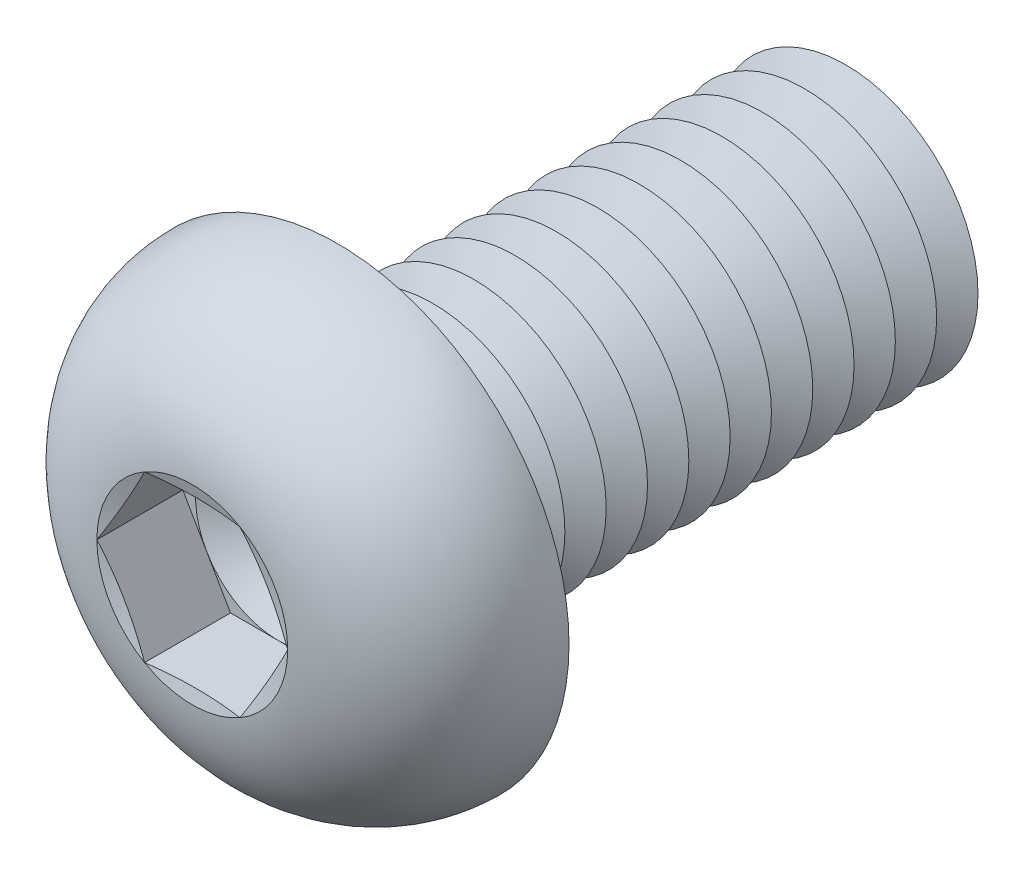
ISO-10303-21;
HEADER;
FILE_DESCRIPTION(('STEP AP214'),'2;1');
FILE_NAME('part.step','',(''),(''),'','','');
FILE_SCHEMA(('AUTOMOTIVE_DESIGN { 1 0 10303 214 1 1 1 1 }'));
ENDSEC;
DATA;
#1=APPLICATION_CONTEXT('core data for automotive mechanical design processes');
#2=APPLICATION_PROTOCOL_DEFINITION('international standard','automotive_design',2000,#1);
#3=PRODUCT_CONTEXT('',#1,'mechanical');
#4=PRODUCT('Part','Part','',(#3));
#5=PRODUCT_RELATED_PRODUCT_CATEGORY('part','',(#4));
#6=PRODUCT_DEFINITION_FORMATION('','',#4);
#7=PRODUCT_DEFINITION_CONTEXT('part definition',#1,'design');
#8=PRODUCT_DEFINITION('design','',#6,#7);
#9=PRODUCT_DEFINITION_SHAPE('','',#8);
#10=(LENGTH_UNIT() NAMED_UNIT(*) SI_UNIT(.MILLI.,.METRE.));
#11=(NAMED_UNIT(*) PLANE_ANGLE_UNIT() SI_UNIT($,.RADIAN.));
#12=(NAMED_UNIT(*) SI_UNIT($,.STERADIAN.) SOLID_ANGLE_UNIT());
#13=UNCERTAINTY_MEASURE_WITH_UNIT(LENGTH_MEASURE(1.E-05),#10,'distance_accuracy_value','');
#14=(GEOMETRIC_REPRESENTATION_CONTEXT(3) GLOBAL_UNCERTAINTY_ASSIGNED_CONTEXT((#13)) GLOBAL_UNIT_ASSIGNED_CONTEXT((#10,
#11,#12)) REPRESENTATION_CONTEXT('',''));
#15=CARTESIAN_POINT('',(0.,0.,0.));
#16=DIRECTION('',(0.,0.,1.));
#17=DIRECTION('',(1.,0.,0.));
#18=AXIS2_PLACEMENT_3D('',#15,#16,#17);
#19=CARTESIAN_POINT('',(0.,0.,1.8));
#20=DIRECTION('',(0.,0.,1.));
#21=DIRECTION('',(1.,0.,0.));
#22=AXIS2_PLACEMENT_3D('',#19,#20,#21);
#23=PLANE('',#22);
#24=CARTESIAN_POINT('',(0.,0.,1.8));
#25=DIRECTION('',(0.,0.,1.));
#26=DIRECTION('',(1.,0.,0.));
#27=AXIS2_PLACEMENT_3D('',#24,#25,#26);
#28=CIRCLE('',#27,2.49999883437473);
#29=CARTESIAN_POINT('',(2.1650625,1.24999941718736,1.8));
#30=VERTEX_POINT('',#29);
#31=CARTESIAN_POINT('',(0.,2.49999883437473,1.8));
#32=VERTEX_POINT('',#31);
#33=EDGE_CURVE('E118',#30,#32,#28,.T.);
#34=ORIENTED_EDGE('',*,*,#33,.F.);
#35=DIRECTION('',(-0.5,0.866025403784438,0.));
#36=VECTOR('',#35,1.);
#37=CARTESIAN_POINT('',(2.88675,0.,1.8));
#38=LINE('',#37,#36);
#39=CARTESIAN_POINT('',(1.443375,2.49999883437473,1.8));
#40=VERTEX_POINT('',#39);
#41=EDGE_CURVE('E125',#30,#40,#38,.T.);
#42=ORIENTED_EDGE('',*,*,#41,.T.);
#43=DIRECTION('',(-1.,0.,0.));
#44=VECTOR('',#43,1.);
#45=CARTESIAN_POINT('',(1.443375,2.49999883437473,1.8));
#46=LINE('',#45,#44);
#47=EDGE_CURVE('E136',#40,#32,#46,.T.);
#48=ORIENTED_EDGE('',*,*,#47,.T.);
#49=EDGE_LOOP('',(#34,#42,#48));
#50=FACE_BOUND('',#49,.T.);
#51=ADVANCED_FACE('F39',(#50),#23,.T.);
#52=CARTESIAN_POINT('',(0.,0.,1.8));
#53=DIRECTION('',(0.,0.,1.));
#54=DIRECTION('',(1.,0.,0.));
#55=AXIS2_PLACEMENT_3D('',#52,#53,#54);
#56=CIRCLE('',#55,2.49999883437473);
#57=CARTESIAN_POINT('',(-2.1650625,1.24999941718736,1.8));
#58=VERTEX_POINT('',#57);
#59=EDGE_CURVE('E11',#32,#58,#56,.T.);
#60=ORIENTED_EDGE('',*,*,#59,.F.);
#61=CARTESIAN_POINT('',(-1.443375,2.49999883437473,1.8));
#62=VERTEX_POINT('',#61);
#63=EDGE_CURVE('E131',#32,#62,#46,.T.);
#64=ORIENTED_EDGE('',*,*,#63,.T.);
#65=DIRECTION('',(-0.5,-0.866025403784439,0.));
#66=VECTOR('',#65,1.);
#67=CARTESIAN_POINT('',(-1.443375,2.49999883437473,1.8));
#68=LINE('',#67,#66);
#69=EDGE_CURVE('E134',#62,#58,#68,.T.);
#70=ORIENTED_EDGE('',*,*,#69,.T.);
#71=EDGE_LOOP('',(#60,#64,#70));
#72=FACE_BOUND('',#71,.T.);
#73=ADVANCED_FACE('F130',(#72),#23,.T.);
#74=CARTESIAN_POINT('',(-2.1650625,-1.24999941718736,1.8));
#75=VERTEX_POINT('',#74);
#76=EDGE_CURVE('E49',#58,#75,#56,.T.);
#77=ORIENTED_EDGE('',*,*,#76,.F.);
#78=CARTESIAN_POINT('',(-2.88675,0.,1.8));
#79=VERTEX_POINT('',#78);
#80=EDGE_CURVE('E143',#58,#79,#68,.T.);
#81=ORIENTED_EDGE('',*,*,#80,.T.);
#82=DIRECTION('',(0.5,-0.866025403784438,0.));
#83=VECTOR('',#82,1.);
#84=CARTESIAN_POINT('',(-2.88675,0.,1.8));
#85=LINE('',#84,#83);
#86=EDGE_CURVE('E151',#79,#75,#85,.T.);
#87=ORIENTED_EDGE('',*,*,#86,.T.);
#88=EDGE_LOOP('',(#77,#81,#87));
#89=FACE_BOUND('',#88,.T.);
#90=ADVANCED_FACE('F369',(#89),#23,.T.);
#91=CARTESIAN_POINT('',(0.,-2.49999883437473,1.8));
#92=VERTEX_POINT('',#91);
#93=EDGE_CURVE('E353',#75,#92,#56,.T.);
#94=ORIENTED_EDGE('',*,*,#93,.F.);
#95=CARTESIAN_POINT('',(-1.443375,-2.49999883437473,1.8));
#96=VERTEX_POINT('',#95);
#97=EDGE_CURVE('E150',#75,#96,#85,.T.);
#98=ORIENTED_EDGE('',*,*,#97,.T.);
#99=DIRECTION('',(1.,0.,0.));
#100=VECTOR('',#99,1.);
#101=CARTESIAN_POINT('',(-1.443375,-2.49999883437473,1.8));
#102=LINE('',#101,#100);
#103=EDGE_CURVE('E156',#96,#92,#102,.T.);
#104=ORIENTED_EDGE('',*,*,#103,.T.);
#105=EDGE_LOOP('',(#94,#98,#104));
#106=FACE_BOUND('',#105,.T.);
#107=ADVANCED_FACE('F363',(#106),#23,.T.);
#108=CARTESIAN_POINT('',(2.1650625,-1.24999941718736,1.8));
#109=VERTEX_POINT('',#108);
#110=EDGE_CURVE('E56',#92,#109,#56,.T.);
#111=ORIENTED_EDGE('',*,*,#110,.F.);
#112=CARTESIAN_POINT('',(1.443375,-2.49999883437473,1.8));
#113=VERTEX_POINT('',#112);
#114=EDGE_CURVE('E155',#92,#113,#102,.T.);
#115=ORIENTED_EDGE('',*,*,#114,.T.);
#116=DIRECTION('',(0.5,0.866025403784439,0.));
#117=VECTOR('',#116,1.);
#118=CARTESIAN_POINT('',(1.443375,-2.49999883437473,1.8));
#119=LINE('',#118,#117);
#120=EDGE_CURVE('E161',#113,#109,#119,.T.);
#121=ORIENTED_EDGE('',*,*,#120,.T.);
#122=EDGE_LOOP('',(#111,#115,#121));
#123=FACE_BOUND('',#122,.T.);
#124=ADVANCED_FACE('F441',(#123),#23,.T.);
#125=CARTESIAN_POINT('',(0.,0.,4.4));
#126=DIRECTION('',(0.,0.,1.));
#127=DIRECTION('',(1.,0.,0.));
#128=AXIS2_PLACEMENT_3D('',#125,#126,#127);
#129=CONICAL_SURFACE('',#128,2.88675,1.30899693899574);
#130=CARTESIAN_POINT('',(2.88686547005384,-0.000199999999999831,4.40003094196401));
#131=CARTESIAN_POINT('',(2.82691617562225,0.103635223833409,4.3839595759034));
#132=CARTESIAN_POINT('',(2.76685817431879,0.207658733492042,4.36936933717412));
#133=CARTESIAN_POINT('',(2.64653003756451,0.416073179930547,4.3437355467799));
#134=CARTESIAN_POINT('',(2.58625982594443,0.520464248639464,4.33269343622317));
#135=CARTESIAN_POINT('',(2.46587274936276,0.728980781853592,4.31480063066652));
#136=CARTESIAN_POINT('',(2.40575669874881,0.833104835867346,4.3079285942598));
#137=CARTESIAN_POINT('',(2.28544792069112,1.0414857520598,4.29871388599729));
#138=CARTESIAN_POINT('',(2.22525521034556,1.14574258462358,4.29637033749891));
#139=CARTESIAN_POINT('',(2.10486978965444,1.35425624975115,4.29637033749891));
#140=CARTESIAN_POINT('',(2.04467707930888,1.45851308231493,4.29871388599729));
#141=CARTESIAN_POINT('',(1.92436830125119,1.66689399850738,4.3079285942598));
#142=CARTESIAN_POINT('',(1.86425225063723,1.77101805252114,4.31480063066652));
#143=CARTESIAN_POINT('',(1.74386517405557,1.97953458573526,4.33269343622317));
#144=CARTESIAN_POINT('',(1.68359496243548,2.08392565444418,4.3437355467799));
#145=CARTESIAN_POINT('',(1.56326682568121,2.29234010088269,4.36936933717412));
#146=CARTESIAN_POINT('',(1.50320882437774,2.39636361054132,4.3839595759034));
#147=CARTESIAN_POINT('',(1.44325952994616,2.50019883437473,4.40003094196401));
#148=B_SPLINE_CURVE_WITH_KNOTS('',3,(#130,#131,#132,#133,#134,#135,#136,#137,#138,#139,#140,
#141,#142,#143,#144,#145,#146,#147),.UNSPECIFIED.,.F.,.F.,(4,2,2,2,2,2,2,2,4),(0.,
0.362931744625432,0.726010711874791,1.08721550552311,1.44835036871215,1.80948523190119,
2.17069002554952,2.53376899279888,2.89670073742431),.UNSPECIFIED.);
#149=CARTESIAN_POINT('',(2.88675,0.,4.4));
#150=VERTEX_POINT('',#149);
#151=CARTESIAN_POINT('',(1.44337499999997,2.49999883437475,4.4));
#152=VERTEX_POINT('',#151);
#153=EDGE_CURVE('E220',#150,#152,#148,.T.);
#154=ORIENTED_EDGE('',*,*,#153,.F.);
#155=CARTESIAN_POINT('',(0.,0.,4.4));
#156=DIRECTION('',(0.,0.,-1.));
#157=DIRECTION('',(-1.,0.,0.));
#158=AXIS2_PLACEMENT_3D('',#155,#156,#157);
#159=CIRCLE('',#158,2.88675);
#160=EDGE_CURVE('E400',#152,#150,#159,.T.);
#161=ORIENTED_EDGE('',*,*,#160,.F.);
#162=EDGE_LOOP('',(#154,#161));
#163=FACE_BOUND('',#162,.T.);
#164=ADVANCED_FACE('F445',(#163),#129,.F.);
#165=CARTESIAN_POINT('',(1.44325952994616,-2.50019883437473,4.40003094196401));
#166=CARTESIAN_POINT('',(1.50320882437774,-2.39636361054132,4.3839595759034));
#167=CARTESIAN_POINT('',(1.56326682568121,-2.29234010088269,4.36936933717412));
#168=CARTESIAN_POINT('',(1.68359496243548,-2.08392565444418,4.3437355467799));
#169=CARTESIAN_POINT('',(1.74386517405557,-1.97953458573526,4.33269343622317));
#170=CARTESIAN_POINT('',(1.86425225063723,-1.77101805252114,4.31480063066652));
#171=CARTESIAN_POINT('',(1.92436830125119,-1.66689399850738,4.3079285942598));
#172=CARTESIAN_POINT('',(2.04467707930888,-1.45851308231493,4.29871388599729));
#173=CARTESIAN_POINT('',(2.10486978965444,-1.35425624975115,4.29637033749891));
#174=CARTESIAN_POINT('',(2.22525521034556,-1.14574258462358,4.29637033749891));
#175=CARTESIAN_POINT('',(2.28544792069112,-1.0414857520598,4.29871388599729));
#176=CARTESIAN_POINT('',(2.40575669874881,-0.833104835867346,4.3079285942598));
#177=CARTESIAN_POINT('',(2.46587274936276,-0.728980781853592,4.31480063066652));
#178=CARTESIAN_POINT('',(2.58625982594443,-0.520464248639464,4.33269343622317));
#179=CARTESIAN_POINT('',(2.64653003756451,-0.416073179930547,4.3437355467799));
#180=CARTESIAN_POINT('',(2.76685817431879,-0.207658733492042,4.36936933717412));
#181=CARTESIAN_POINT('',(2.82691617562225,-0.103635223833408,4.3839595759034));
#182=CARTESIAN_POINT('',(2.88686547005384,0.000200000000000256,4.40003094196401));
#183=B_SPLINE_CURVE_WITH_KNOTS('',3,(#165,#166,#167,#168,#169,#170,#171,#172,#173,#174,#175,
#176,#177,#178,#179,#180,#181,#182),.UNSPECIFIED.,.F.,.F.,(4,2,2,2,2,2,2,2,4),(0.,
0.362931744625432,0.726010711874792,1.08721550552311,1.44835036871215,1.80948523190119,
2.17069002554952,2.53376899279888,2.89670073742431),.UNSPECIFIED.);
#184=CARTESIAN_POINT('',(1.443375,-2.49999883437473,4.4));
#185=VERTEX_POINT('',#184);
#186=EDGE_CURVE('E229',#185,#150,#183,.T.);
#187=ORIENTED_EDGE('',*,*,#186,.F.);
#188=EDGE_CURVE('E402',#150,#185,#159,.T.);
#189=ORIENTED_EDGE('',*,*,#188,.F.);
#190=EDGE_LOOP('',(#187,#189));
#191=FACE_BOUND('',#190,.T.);
#192=ADVANCED_FACE('F407',(#191),#129,.F.);
#193=CARTESIAN_POINT('',(-4.35611719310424,-2.49999883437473,4.97227902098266));
#194=CARTESIAN_POINT('',(-4.25066509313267,-2.49999883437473,4.94777440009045));
#195=CARTESIAN_POINT('',(-4.14516541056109,-2.49999883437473,4.92347459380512));
#196=CARTESIAN_POINT('',(-3.93405094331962,-2.49999883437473,4.87537247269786));
#197=CARTESIAN_POINT('',(-3.82843615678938,-2.49999883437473,4.85157016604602));
#198=CARTESIAN_POINT('',(-3.5113534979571,-2.49999883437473,4.78103338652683));
#199=CARTESIAN_POINT('',(-3.29968815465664,-2.49999883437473,4.73517861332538));
#200=CARTESIAN_POINT('',(-2.87365524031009,-2.49999883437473,4.64645582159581));
#201=CARTESIAN_POINT('',(-2.65928093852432,-2.49999883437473,4.60361983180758));
#202=CARTESIAN_POINT('',(-2.22952626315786,-2.49999883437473,4.52311285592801));
#203=CARTESIAN_POINT('',(-2.01414580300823,-2.49999883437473,4.48544232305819));
#204=CARTESIAN_POINT('',(-1.58798319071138,-2.49999883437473,4.41876559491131));
#205=CARTESIAN_POINT('',(-1.37723418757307,-2.49999883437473,4.38955265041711));
#206=CARTESIAN_POINT('',(-0.954530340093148,-2.49999883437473,4.34171384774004));
#207=CARTESIAN_POINT('',(-0.742575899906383,-2.49999883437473,4.32308463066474));
#208=CARTESIAN_POINT('',(-0.424544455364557,-2.49999883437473,4.30539140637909));
#209=CARTESIAN_POINT('',(-0.318745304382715,-2.49999883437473,4.30120018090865));
#210=CARTESIAN_POINT('',(-0.107062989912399,-2.49999883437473,4.29638997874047));
#211=CARTESIAN_POINT('',(-0.00117982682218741,-2.49999883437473,4.29577098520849));
#212=CARTESIAN_POINT('',(0.210552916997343,-2.49999883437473,4.29814378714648));
#213=CARTESIAN_POINT('',(0.316402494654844,-2.49999883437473,4.30113585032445));
#214=CARTESIAN_POINT('',(0.527944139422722,-2.49999883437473,4.31057322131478));
#215=CARTESIAN_POINT('',(0.633636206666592,-2.49999883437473,4.31701852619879));
#216=CARTESIAN_POINT('',(0.890304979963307,-2.49999883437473,4.33652018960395));
#217=CARTESIAN_POINT('',(1.0411561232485,-2.49999883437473,4.35122885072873));
#218=CARTESIAN_POINT('',(1.34222474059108,-2.49999883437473,4.38593609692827));
#219=CARTESIAN_POINT('',(1.49244223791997,-2.49999883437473,4.40593448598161));
#220=CARTESIAN_POINT('',(1.79273634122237,-2.49999883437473,4.45011321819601));
#221=CARTESIAN_POINT('',(1.94281100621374,-2.49999883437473,4.47430656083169));
#222=CARTESIAN_POINT('',(2.24242097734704,-2.49999883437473,4.52583552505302));
#223=CARTESIAN_POINT('',(2.39195625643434,-2.49999883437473,4.55317130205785));
#224=CARTESIAN_POINT('',(2.69364402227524,-2.49999883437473,4.61079781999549));
#225=CARTESIAN_POINT('',(2.8457870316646,-2.49999883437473,4.64113779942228));
#226=CARTESIAN_POINT('',(3.14969016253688,-2.49999883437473,4.70367638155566));
#227=CARTESIAN_POINT('',(3.30145027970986,-2.49999883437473,4.73587500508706));
#228=CARTESIAN_POINT('',(3.60383766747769,-2.49999883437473,4.80150275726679));
#229=CARTESIAN_POINT('',(3.75446660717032,-2.49999883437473,4.83492423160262));
#230=CARTESIAN_POINT('',(4.05546753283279,-2.49999883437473,4.90285814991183));
#231=CARTESIAN_POINT('',(4.2058395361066,-2.49999883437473,4.9373705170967));
#232=CARTESIAN_POINT('',(4.35611719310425,-2.49999883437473,4.97227902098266));
#233=B_SPLINE_CURVE_WITH_KNOTS('',3,(#193,#194,#195,#196,#197,#198,#199,#200,#201,#202,#203,
#204,#205,#206,#207,#208,#209,#210,#211,#212,#213,#214,#215,#216,#217,#218,#219,#220,#221,#222,
#223,#224,#225,#226,#227,#228,#229,#230,#231,#232),.UNSPECIFIED.,.F.,.F.,(4,2,2,2,2,2,2,2,2,2,2,
2,2,2,2,2,2,2,2,4),(0.,0.324785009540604,0.6495753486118,1.29928181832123,1.95507889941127,
2.61093348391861,3.24905289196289,3.88696967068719,4.204563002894,4.5221548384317,
4.83977022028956,5.15738533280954,5.61196030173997,6.06651842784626,6.52251118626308,
6.97852650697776,7.44392737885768,7.90933346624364,8.37220553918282,8.83504510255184),.UNSPECIFIED.);
#234=CARTESIAN_POINT('',(-1.443375,-2.49999883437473,4.4));
#235=VERTEX_POINT('',#234);
#236=EDGE_CURVE('E381',#235,#185,#233,.T.);
#237=ORIENTED_EDGE('',*,*,#236,.F.);
#238=EDGE_CURVE('E389',#185,#235,#159,.T.);
#239=ORIENTED_EDGE('',*,*,#238,.F.);
#240=EDGE_LOOP('',(#237,#239));
#241=FACE_BOUND('',#240,.T.);
#242=ADVANCED_FACE('F413',(#241),#129,.F.);
#243=CARTESIAN_POINT('',(-2.88686547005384,0.000200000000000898,4.40003094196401));
#244=CARTESIAN_POINT('',(-2.82691617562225,-0.103635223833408,4.3839595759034));
#245=CARTESIAN_POINT('',(-2.76685817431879,-0.207658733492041,4.36936933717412));
#246=CARTESIAN_POINT('',(-2.64653003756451,-0.416073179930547,4.3437355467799));
#247=CARTESIAN_POINT('',(-2.58625982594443,-0.520464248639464,4.33269343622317));
#248=CARTESIAN_POINT('',(-2.46587274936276,-0.728980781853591,4.31480063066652));
#249=CARTESIAN_POINT('',(-2.40575669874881,-0.833104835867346,4.3079285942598));
#250=CARTESIAN_POINT('',(-2.28544792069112,-1.0414857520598,4.29871388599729));
#251=CARTESIAN_POINT('',(-2.22525521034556,-1.14574258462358,4.29637033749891));
#252=CARTESIAN_POINT('',(-2.10486978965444,-1.35425624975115,4.29637033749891));
#253=CARTESIAN_POINT('',(-2.04467707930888,-1.45851308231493,4.29871388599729));
#254=CARTESIAN_POINT('',(-1.92436830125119,-1.66689399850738,4.3079285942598));
#255=CARTESIAN_POINT('',(-1.86425225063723,-1.77101805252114,4.31480063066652));
#256=CARTESIAN_POINT('',(-1.74386517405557,-1.97953458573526,4.33269343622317));
#257=CARTESIAN_POINT('',(-1.68359496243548,-2.08392565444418,4.3437355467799));
#258=CARTESIAN_POINT('',(-1.56326682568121,-2.29234010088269,4.36936933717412));
#259=CARTESIAN_POINT('',(-1.50320882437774,-2.39636361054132,4.3839595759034));
#260=CARTESIAN_POINT('',(-1.44325952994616,-2.50019883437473,4.40003094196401));
#261=B_SPLINE_CURVE_WITH_KNOTS('',3,(#243,#244,#245,#246,#247,#248,#249,#250,#251,#252,#253,
#254,#255,#256,#257,#258,#259,#260),.UNSPECIFIED.,.F.,.F.,(4,2,2,2,2,2,2,2,4),(0.,
0.362931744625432,0.726010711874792,1.08721550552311,1.44835036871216,1.8094852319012,
2.17069002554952,2.53376899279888,2.89670073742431),.UNSPECIFIED.);
#262=CARTESIAN_POINT('',(-2.88675,0.,4.4));
#263=VERTEX_POINT('',#262);
#264=EDGE_CURVE('E374',#263,#235,#261,.T.);
#265=ORIENTED_EDGE('',*,*,#264,.F.);
#266=EDGE_CURVE('E331',#235,#263,#159,.T.);
#267=ORIENTED_EDGE('',*,*,#266,.F.);
#268=EDGE_LOOP('',(#265,#267));
#269=FACE_BOUND('',#268,.T.);
#270=ADVANCED_FACE('F378',(#269),#129,.F.);
#271=CARTESIAN_POINT('',(-1.44325952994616,2.50019883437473,4.40003094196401));
#272=CARTESIAN_POINT('',(-1.50320882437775,2.39636361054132,4.3839595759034));
#273=CARTESIAN_POINT('',(-1.56326682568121,2.29234010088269,4.36936933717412));
#274=CARTESIAN_POINT('',(-1.68359496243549,2.08392565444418,4.3437355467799));
#275=CARTESIAN_POINT('',(-1.74386517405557,1.97953458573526,4.33269343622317));
#276=CARTESIAN_POINT('',(-1.86425225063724,1.77101805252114,4.31480063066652));
#277=CARTESIAN_POINT('',(-1.92436830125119,1.66689399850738,4.3079285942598));
#278=CARTESIAN_POINT('',(-2.04467707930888,1.45851308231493,4.29871388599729));
#279=CARTESIAN_POINT('',(-2.10486978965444,1.35425624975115,4.29637033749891));
#280=CARTESIAN_POINT('',(-2.22525521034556,1.14574258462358,4.29637033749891));
#281=CARTESIAN_POINT('',(-2.28544792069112,1.0414857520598,4.29871388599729));
#282=CARTESIAN_POINT('',(-2.40575669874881,0.833104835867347,4.3079285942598));
#283=CARTESIAN_POINT('',(-2.46587274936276,0.728980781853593,4.31480063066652));
#284=CARTESIAN_POINT('',(-2.58625982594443,0.520464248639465,4.33269343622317));
#285=CARTESIAN_POINT('',(-2.64653003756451,0.416073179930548,4.3437355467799));
#286=CARTESIAN_POINT('',(-2.76685817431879,0.207658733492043,4.36936933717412));
#287=CARTESIAN_POINT('',(-2.82691617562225,0.10363522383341,4.3839595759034));
#288=CARTESIAN_POINT('',(-2.88686547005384,-0.000199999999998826,4.40003094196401));
#289=B_SPLINE_CURVE_WITH_KNOTS('',3,(#271,#272,#273,#274,#275,#276,#277,#278,#279,#280,#281,
#282,#283,#284,#285,#286,#287,#288),.UNSPECIFIED.,.F.,.F.,(4,2,2,2,2,2,2,2,4),(0.,
0.362931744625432,0.726010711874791,1.08721550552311,1.44835036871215,1.80948523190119,
2.17069002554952,2.53376899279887,2.89670073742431),.UNSPECIFIED.);
#290=CARTESIAN_POINT('',(-1.443375,2.49999883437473,4.4));
#291=VERTEX_POINT('',#290);
#292=EDGE_CURVE('E193',#291,#263,#289,.T.);
#293=ORIENTED_EDGE('',*,*,#292,.F.);
#294=EDGE_CURVE('E332',#263,#291,#159,.T.);
#295=ORIENTED_EDGE('',*,*,#294,.F.);
#296=EDGE_LOOP('',(#293,#295));
#297=FACE_BOUND('',#296,.T.);
#298=ADVANCED_FACE('F392',(#297),#129,.F.);
#299=CARTESIAN_POINT('',(0.,0.,-11.625));
#300=DIRECTION('',(0.,0.,1.));
#301=DIRECTION('',(1.,0.,0.));
#302=AXIS2_PLACEMENT_3D('',#299,#300,#301);
#303=CONICAL_SURFACE('',#302,4.,1.0471975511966);
#304=CARTESIAN_POINT('',(0.,0.,-12.25));
#305=DIRECTION('',(0.,0.,1.));
#306=DIRECTION('',(1.,0.,0.));
#307=AXIS2_PLACEMENT_3D('',#304,#305,#306);
#308=CIRCLE('',#307,2.91746824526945);
#309=CARTESIAN_POINT('',(2.91746824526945,0.,-12.25));
#310=VERTEX_POINT('',#309);
#311=EDGE_CURVE('E303',#310,#310,#308,.T.);
#312=ORIENTED_EDGE('',*,*,#311,.T.);
#313=EDGE_LOOP('',(#312));
#314=FACE_BOUND('',#313,.T.);
#315=CARTESIAN_POINT('',(0.,0.,-11.625));
#316=DIRECTION('',(0.,0.,1.));
#317=DIRECTION('',(1.,0.,0.));
#318=AXIS2_PLACEMENT_3D('',#315,#316,#317);
#319=CIRCLE('',#318,4.);
#320=CARTESIAN_POINT('',(4.,0.,-11.625));
#321=VERTEX_POINT('',#320);
#322=EDGE_CURVE('E299',#321,#321,#319,.T.);
#323=ORIENTED_EDGE('',*,*,#322,.F.);
#324=EDGE_LOOP('',(#323));
#325=FACE_BOUND('',#324,.T.);
#326=ADVANCED_FACE('F579',(#314,#325),#303,.T.);
#327=CARTESIAN_POINT('',(0.,0.,-12.25));
#328=DIRECTION('',(0.,0.,-1.));
#329=DIRECTION('',(-1.,0.,0.));
#330=AXIS2_PLACEMENT_3D('',#327,#328,#329);
#331=CONICAL_SURFACE('',#330,2.91746824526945,1.0471975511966);
#332=CARTESIAN_POINT('',(0.,0.,-12.875));
#333=DIRECTION('',(0.,0.,1.));
#334=DIRECTION('',(1.,0.,0.));
#335=AXIS2_PLACEMENT_3D('',#332,#333,#334);
#336=CIRCLE('',#335,4.);
#337=CARTESIAN_POINT('',(4.,0.,-12.875));
#338=VERTEX_POINT('',#337);
#339=EDGE_CURVE('E307',#338,#338,#336,.T.);
#340=ORIENTED_EDGE('',*,*,#339,.T.);
#341=EDGE_LOOP('',(#340));
#342=FACE_BOUND('',#341,.T.);
#343=ORIENTED_EDGE('',*,*,#311,.F.);
#344=EDGE_LOOP('',(#343));
#345=FACE_BOUND('',#344,.T.);
#346=ADVANCED_FACE('F782',(#342,#345),#331,.T.);
#347=CARTESIAN_POINT('',(0.,4.00000000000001,-16.));
#348=DIRECTION('',(0.,0.,-1.));
#349=DIRECTION('',(-1.,0.,0.));
#350=AXIS2_PLACEMENT_3D('',#347,#348,#349);
#351=PLANE('',#350);
#352=CARTESIAN_POINT('',(0.,0.,-16.));
#353=DIRECTION('',(0.,0.,1.));
#354=DIRECTION('',(1.,0.,0.));
#355=AXIS2_PLACEMENT_3D('',#352,#353,#354);
#356=CIRCLE('',#355,2.91746824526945);
#357=CARTESIAN_POINT('',(2.91746824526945,0.,-16.));
#358=VERTEX_POINT('',#357);
#359=EDGE_CURVE('E327',#358,#358,#356,.T.);
#360=ORIENTED_EDGE('',*,*,#359,.F.);
#361=EDGE_LOOP('',(#360));
#362=FACE_BOUND('',#361,.T.);
#363=ADVANCED_FACE('F787',(#362),#351,.T.);
#364=CARTESIAN_POINT('',(0.,0.,-15.375));
#365=DIRECTION('',(0.,0.,1.));
#366=DIRECTION('',(1.,0.,0.));
#367=AXIS2_PLACEMENT_3D('',#364,#365,#366);
#368=CONICAL_SURFACE('',#367,4.,1.0471975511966);
#369=ORIENTED_EDGE('',*,*,#359,.T.);
#370=EDGE_LOOP('',(#369));
#371=FACE_BOUND('',#370,.T.);
#372=CARTESIAN_POINT('',(0.,0.,-15.375));
#373=DIRECTION('',(0.,0.,1.));
#374=DIRECTION('',(1.,0.,0.));
#375=AXIS2_PLACEMENT_3D('',#372,#373,#374);
#376=CIRCLE('',#375,4.);
#377=CARTESIAN_POINT('',(4.,0.,-15.375));
#378=VERTEX_POINT('',#377);
#379=EDGE_CURVE('E323',#378,#378,#376,.T.);
#380=ORIENTED_EDGE('',*,*,#379,.F.);
#381=EDGE_LOOP('',(#380));
#382=FACE_BOUND('',#381,.T.);
#383=ADVANCED_FACE('F776',(#371,#382),#368,.T.);
#384=CARTESIAN_POINT('',(0.,0.,-14.75));
#385=DIRECTION('',(0.,0.,-1.));
#386=DIRECTION('',(-1.,0.,0.));
#387=AXIS2_PLACEMENT_3D('',#384,#385,#386);
#388=CONICAL_SURFACE('',#387,2.91746824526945,1.0471975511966);
#389=ORIENTED_EDGE('',*,*,#379,.T.);
#390=EDGE_LOOP('',(#389));
#391=FACE_BOUND('',#390,.T.);
#392=CARTESIAN_POINT('',(0.,0.,-14.75));
#393=DIRECTION('',(0.,0.,1.));
#394=DIRECTION('',(1.,0.,0.));
#395=AXIS2_PLACEMENT_3D('',#392,#393,#394);
#396=CIRCLE('',#395,2.91746824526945);
#397=CARTESIAN_POINT('',(2.91746824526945,0.,-14.75));
#398=VERTEX_POINT('',#397);
#399=EDGE_CURVE('E319',#398,#398,#396,.T.);
#400=ORIENTED_EDGE('',*,*,#399,.F.);
#401=EDGE_LOOP('',(#400));
#402=FACE_BOUND('',#401,.T.);
#403=ADVANCED_FACE('F766',(#391,#402),#388,.T.);
#404=CARTESIAN_POINT('',(0.,0.,-14.125));
#405=DIRECTION('',(0.,0.,1.));
#406=DIRECTION('',(1.,0.,0.));
#407=AXIS2_PLACEMENT_3D('',#404,#405,#406);
#408=CONICAL_SURFACE('',#407,4.,1.0471975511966);
#409=ORIENTED_EDGE('',*,*,#399,.T.);
#410=EDGE_LOOP('',(#409));
#411=FACE_BOUND('',#410,.T.);
#412=CARTESIAN_POINT('',(0.,0.,-14.125));
#413=DIRECTION('',(0.,0.,1.));
#414=DIRECTION('',(1.,0.,0.));
#415=AXIS2_PLACEMENT_3D('',#412,#413,#414);
#416=CIRCLE('',#415,4.);
#417=CARTESIAN_POINT('',(4.,0.,-14.125));
#418=VERTEX_POINT('',#417);
#419=EDGE_CURVE('E315',#418,#418,#416,.T.);
#420=ORIENTED_EDGE('',*,*,#419,.F.);
#421=EDGE_LOOP('',(#420));
#422=FACE_BOUND('',#421,.T.);
#423=ADVANCED_FACE('F756',(#411,#422),#408,.T.);
#424=CARTESIAN_POINT('',(0.,0.,-13.5));
#425=DIRECTION('',(0.,0.,-1.));
#426=DIRECTION('',(-1.,0.,0.));
#427=AXIS2_PLACEMENT_3D('',#424,#425,#426);
#428=CONICAL_SURFACE('',#427,2.91746824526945,1.0471975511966);
#429=ORIENTED_EDGE('',*,*,#419,.T.);
#430=EDGE_LOOP('',(#429));
#431=FACE_BOUND('',#430,.T.);
#432=CARTESIAN_POINT('',(0.,0.,-13.5));
#433=DIRECTION('',(0.,0.,1.));
#434=DIRECTION('',(1.,0.,0.));
#435=AXIS2_PLACEMENT_3D('',#432,#433,#434);
#436=CIRCLE('',#435,2.91746824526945);
#437=CARTESIAN_POINT('',(2.91746824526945,0.,-13.5));
#438=VERTEX_POINT('',#437);
#439=EDGE_CURVE('E311',#438,#438,#436,.T.);
#440=ORIENTED_EDGE('',*,*,#439,.F.);
#441=EDGE_LOOP('',(#440));
#442=FACE_BOUND('',#441,.T.);
#443=ADVANCED_FACE('F746',(#431,#442),#428,.T.);
#444=CARTESIAN_POINT('',(0.,0.,-12.875));
#445=DIRECTION('',(0.,0.,1.));
#446=DIRECTION('',(1.,0.,0.));
#447=AXIS2_PLACEMENT_3D('',#444,#445,#446);
#448=CONICAL_SURFACE('',#447,4.,1.0471975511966);
#449=ORIENTED_EDGE('',*,*,#439,.T.);
#450=EDGE_LOOP('',(#449));
#451=FACE_BOUND('',#450,.T.);
#452=ORIENTED_EDGE('',*,*,#339,.F.);
#453=EDGE_LOOP('',(#452));
#454=FACE_BOUND('',#453,.T.);
#455=ADVANCED_FACE('F736',(#451,#454),#448,.T.);
#456=CARTESIAN_POINT('',(0.,0.,-10.375));
#457=DIRECTION('',(0.,0.,1.));
#458=DIRECTION('',(1.,0.,0.));
#459=AXIS2_PLACEMENT_3D('',#456,#457,#458);
#460=CONICAL_SURFACE('',#459,4.,1.0471975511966);
#461=CARTESIAN_POINT('',(0.,0.,-11.));
#462=DIRECTION('',(0.,0.,1.));
#463=DIRECTION('',(1.,0.,0.));
#464=AXIS2_PLACEMENT_3D('',#461,#462,#463);
#465=CIRCLE('',#464,2.91746824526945);
#466=CARTESIAN_POINT('',(2.91746824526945,0.,-11.));
#467=VERTEX_POINT('',#466);
#468=EDGE_CURVE('E295',#467,#467,#465,.T.);
#469=ORIENTED_EDGE('',*,*,#468,.T.);
#470=EDGE_LOOP('',(#469));
#471=FACE_BOUND('',#470,.T.);
#472=CARTESIAN_POINT('',(0.,0.,-10.375));
#473=DIRECTION('',(0.,0.,1.));
#474=DIRECTION('',(1.,0.,0.));
#475=AXIS2_PLACEMENT_3D('',#472,#473,#474);
#476=CIRCLE('',#475,4.);
#477=CARTESIAN_POINT('',(4.,0.,-10.375));
#478=VERTEX_POINT('',#477);
#479=EDGE_CURVE('E291',#478,#478,#476,.T.);
#480=ORIENTED_EDGE('',*,*,#479,.F.);
#481=EDGE_LOOP('',(#480));
#482=FACE_BOUND('',#481,.T.);
#483=ADVANCED_FACE('F726',(#471,#482),#460,.T.);
#484=CARTESIAN_POINT('',(0.,0.,-11.));
#485=DIRECTION('',(0.,0.,-1.));
#486=DIRECTION('',(-1.,0.,0.));
#487=AXIS2_PLACEMENT_3D('',#484,#485,#486);
#488=CONICAL_SURFACE('',#487,2.91746824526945,1.0471975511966);
#489=ORIENTED_EDGE('',*,*,#322,.T.);
#490=EDGE_LOOP('',(#489));
#491=FACE_BOUND('',#490,.T.);
#492=ORIENTED_EDGE('',*,*,#468,.F.);
#493=EDGE_LOOP('',(#492));
#494=FACE_BOUND('',#493,.T.);
#495=ADVANCED_FACE('F716',(#491,#494),#488,.T.);
#496=CARTESIAN_POINT('',(0.,0.,-9.125));
#497=DIRECTION('',(0.,0.,1.));
#498=DIRECTION('',(1.,0.,0.));
#499=AXIS2_PLACEMENT_3D('',#496,#497,#498);
#500=CONICAL_SURFACE('',#499,4.,1.0471975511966);
#501=CARTESIAN_POINT('',(0.,0.,-9.75));
#502=DIRECTION('',(0.,0.,1.));
#503=DIRECTION('',(1.,0.,0.));
#504=AXIS2_PLACEMENT_3D('',#501,#502,#503);
#505=CIRCLE('',#504,2.91746824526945);
#506=CARTESIAN_POINT('',(2.91746824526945,0.,-9.75));
#507=VERTEX_POINT('',#506);
#508=EDGE_CURVE('E287',#507,#507,#505,.T.);
#509=ORIENTED_EDGE('',*,*,#508,.T.);
#510=EDGE_LOOP('',(#509));
#511=FACE_BOUND('',#510,.T.);
#512=CARTESIAN_POINT('',(0.,0.,-9.125));
#513=DIRECTION('',(0.,0.,1.));
#514=DIRECTION('',(1.,0.,0.));
#515=AXIS2_PLACEMENT_3D('',#512,#513,#514);
#516=CIRCLE('',#515,4.);
#517=CARTESIAN_POINT('',(4.,0.,-9.125));
#518=VERTEX_POINT('',#517);
#519=EDGE_CURVE('E283',#518,#518,#516,.T.);
#520=ORIENTED_EDGE('',*,*,#519,.F.);
#521=EDGE_LOOP('',(#520));
#522=FACE_BOUND('',#521,.T.);
#523=ADVANCED_FACE('F706',(#511,#522),#500,.T.);
#524=CARTESIAN_POINT('',(0.,0.,-9.75));
#525=DIRECTION('',(0.,0.,-1.));
#526=DIRECTION('',(-1.,0.,0.));
#527=AXIS2_PLACEMENT_3D('',#524,#525,#526);
#528=CONICAL_SURFACE('',#527,2.91746824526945,1.0471975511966);
#529=ORIENTED_EDGE('',*,*,#479,.T.);
#530=EDGE_LOOP('',(#529));
#531=FACE_BOUND('',#530,.T.);
#532=ORIENTED_EDGE('',*,*,#508,.F.);
#533=EDGE_LOOP('',(#532));
#534=FACE_BOUND('',#533,.T.);
#535=ADVANCED_FACE('F696',(#531,#534),#528,.T.);
#536=CARTESIAN_POINT('',(0.,0.,-7.875));
#537=DIRECTION('',(0.,0.,1.));
#538=DIRECTION('',(1.,0.,0.));
#539=AXIS2_PLACEMENT_3D('',#536,#537,#538);
#540=CONICAL_SURFACE('',#539,4.,1.0471975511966);
#541=CARTESIAN_POINT('',(0.,0.,-8.5));
#542=DIRECTION('',(0.,0.,1.));
#543=DIRECTION('',(1.,0.,0.));
#544=AXIS2_PLACEMENT_3D('',#541,#542,#543);
#545=CIRCLE('',#544,2.91746824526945);
#546=CARTESIAN_POINT('',(2.91746824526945,0.,-8.5));
#547=VERTEX_POINT('',#546);
#548=EDGE_CURVE('E279',#547,#547,#545,.T.);
#549=ORIENTED_EDGE('',*,*,#548,.T.);
#550=EDGE_LOOP('',(#549));
#551=FACE_BOUND('',#550,.T.);
#552=CARTESIAN_POINT('',(0.,0.,-7.875));
#553=DIRECTION('',(0.,0.,1.));
#554=DIRECTION('',(1.,0.,0.));
#555=AXIS2_PLACEMENT_3D('',#552,#553,#554);
#556=CIRCLE('',#555,4.);
#557=CARTESIAN_POINT('',(4.,0.,-7.875));
#558=VERTEX_POINT('',#557);
#559=EDGE_CURVE('E275',#558,#558,#556,.T.);
#560=ORIENTED_EDGE('',*,*,#559,.F.);
#561=EDGE_LOOP('',(#560));
#562=FACE_BOUND('',#561,.T.);
#563=ADVANCED_FACE('F686',(#551,#562),#540,.T.);
#564=CARTESIAN_POINT('',(0.,0.,-8.5));
#565=DIRECTION('',(0.,0.,-1.));
#566=DIRECTION('',(-1.,0.,0.));
#567=AXIS2_PLACEMENT_3D('',#564,#565,#566);
#568=CONICAL_SURFACE('',#567,2.91746824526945,1.0471975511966);
#569=ORIENTED_EDGE('',*,*,#519,.T.);
#570=EDGE_LOOP('',(#569));
#571=FACE_BOUND('',#570,.T.);
#572=ORIENTED_EDGE('',*,*,#548,.F.);
#573=EDGE_LOOP('',(#572));
#574=FACE_BOUND('',#573,.T.);
#575=ADVANCED_FACE('F676',(#571,#574),#568,.T.);
#576=CARTESIAN_POINT('',(0.,0.,-6.625));
#577=DIRECTION('',(0.,0.,1.));
#578=DIRECTION('',(1.,0.,0.));
#579=AXIS2_PLACEMENT_3D('',#576,#577,#578);
#580=CONICAL_SURFACE('',#579,4.,1.0471975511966);
#581=CARTESIAN_POINT('',(0.,0.,-7.25));
#582=DIRECTION('',(0.,0.,1.));
#583=DIRECTION('',(1.,0.,0.));
#584=AXIS2_PLACEMENT_3D('',#581,#582,#583);
#585=CIRCLE('',#584,2.91746824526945);
#586=CARTESIAN_POINT('',(2.91746824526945,0.,-7.25));
#587=VERTEX_POINT('',#586);
#588=EDGE_CURVE('E271',#587,#587,#585,.T.);
#589=ORIENTED_EDGE('',*,*,#588,.T.);
#590=EDGE_LOOP('',(#589));
#591=FACE_BOUND('',#590,.T.);
#592=CARTESIAN_POINT('',(0.,0.,-6.625));
#593=DIRECTION('',(0.,0.,1.));
#594=DIRECTION('',(1.,0.,0.));
#595=AXIS2_PLACEMENT_3D('',#592,#593,#594);
#596=CIRCLE('',#595,4.);
#597=CARTESIAN_POINT('',(4.,0.,-6.625));
#598=VERTEX_POINT('',#597);
#599=EDGE_CURVE('E267',#598,#598,#596,.T.);
#600=ORIENTED_EDGE('',*,*,#599,.F.);
#601=EDGE_LOOP('',(#600));
#602=FACE_BOUND('',#601,.T.);
#603=ADVANCED_FACE('F666',(#591,#602),#580,.T.);
#604=CARTESIAN_POINT('',(0.,0.,-7.25));
#605=DIRECTION('',(0.,0.,-1.));
#606=DIRECTION('',(-1.,0.,0.));
#607=AXIS2_PLACEMENT_3D('',#604,#605,#606);
#608=CONICAL_SURFACE('',#607,2.91746824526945,1.0471975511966);
#609=ORIENTED_EDGE('',*,*,#559,.T.);
#610=EDGE_LOOP('',(#609));
#611=FACE_BOUND('',#610,.T.);
#612=ORIENTED_EDGE('',*,*,#588,.F.);
#613=EDGE_LOOP('',(#612));
#614=FACE_BOUND('',#613,.T.);
#615=ADVANCED_FACE('F656',(#611,#614),#608,.T.);
#616=CARTESIAN_POINT('',(0.,0.,-5.375));
#617=DIRECTION('',(0.,0.,1.));
#618=DIRECTION('',(1.,0.,0.));
#619=AXIS2_PLACEMENT_3D('',#616,#617,#618);
#620=CONICAL_SURFACE('',#619,4.,1.0471975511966);
#621=CARTESIAN_POINT('',(0.,0.,-6.));
#622=DIRECTION('',(0.,0.,1.));
#623=DIRECTION('',(1.,0.,0.));
#624=AXIS2_PLACEMENT_3D('',#621,#622,#623);
#625=CIRCLE('',#624,2.91746824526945);
#626=CARTESIAN_POINT('',(2.91746824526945,0.,-6.));
#627=VERTEX_POINT('',#626);
#628=EDGE_CURVE('E263',#627,#627,#625,.T.);
#629=ORIENTED_EDGE('',*,*,#628,.T.);
#630=EDGE_LOOP('',(#629));
#631=FACE_BOUND('',#630,.T.);
#632=CARTESIAN_POINT('',(0.,0.,-5.375));
#633=DIRECTION('',(0.,0.,1.));
#634=DIRECTION('',(1.,0.,0.));
#635=AXIS2_PLACEMENT_3D('',#632,#633,#634);
#636=CIRCLE('',#635,4.);
#637=CARTESIAN_POINT('',(4.,0.,-5.375));
#638=VERTEX_POINT('',#637);
#639=EDGE_CURVE('E259',#638,#638,#636,.T.);
#640=ORIENTED_EDGE('',*,*,#639,.F.);
#641=EDGE_LOOP('',(#640));
#642=FACE_BOUND('',#641,.T.);
#643=ADVANCED_FACE('F646',(#631,#642),#620,.T.);
#644=CARTESIAN_POINT('',(0.,0.,-6.));
#645=DIRECTION('',(0.,0.,-1.));
#646=DIRECTION('',(-1.,0.,0.));
#647=AXIS2_PLACEMENT_3D('',#644,#645,#646);
#648=CONICAL_SURFACE('',#647,2.91746824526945,1.0471975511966);
#649=ORIENTED_EDGE('',*,*,#599,.T.);
#650=EDGE_LOOP('',(#649));
#651=FACE_BOUND('',#650,.T.);
#652=ORIENTED_EDGE('',*,*,#628,.F.);
#653=EDGE_LOOP('',(#652));
#654=FACE_BOUND('',#653,.T.);
#655=ADVANCED_FACE('F636',(#651,#654),#648,.T.);
#656=CARTESIAN_POINT('',(0.,0.,-4.125));
#657=DIRECTION('',(0.,0.,1.));
#658=DIRECTION('',(1.,0.,0.));
#659=AXIS2_PLACEMENT_3D('',#656,#657,#658);
#660=CONICAL_SURFACE('',#659,4.,1.0471975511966);
#661=CARTESIAN_POINT('',(0.,0.,-4.75));
#662=DIRECTION('',(0.,0.,1.));
#663=DIRECTION('',(1.,0.,0.));
#664=AXIS2_PLACEMENT_3D('',#661,#662,#663);
#665=CIRCLE('',#664,2.91746824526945);
#666=CARTESIAN_POINT('',(2.91746824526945,0.,-4.75));
#667=VERTEX_POINT('',#666);
#668=EDGE_CURVE('E255',#667,#667,#665,.T.);
#669=ORIENTED_EDGE('',*,*,#668,.T.);
#670=EDGE_LOOP('',(#669));
#671=FACE_BOUND('',#670,.T.);
#672=CARTESIAN_POINT('',(0.,0.,-4.125));
#673=DIRECTION('',(0.,0.,1.));
#674=DIRECTION('',(1.,0.,0.));
#675=AXIS2_PLACEMENT_3D('',#672,#673,#674);
#676=CIRCLE('',#675,4.);
#677=CARTESIAN_POINT('',(4.,0.,-4.125));
#678=VERTEX_POINT('',#677);
#679=EDGE_CURVE('E251',#678,#678,#676,.T.);
#680=ORIENTED_EDGE('',*,*,#679,.F.);
#681=EDGE_LOOP('',(#680));
#682=FACE_BOUND('',#681,.T.);
#683=ADVANCED_FACE('F626',(#671,#682),#660,.T.);
#684=CARTESIAN_POINT('',(0.,0.,-4.75));
#685=DIRECTION('',(0.,0.,-1.));
#686=DIRECTION('',(-1.,0.,0.));
#687=AXIS2_PLACEMENT_3D('',#684,#685,#686);
#688=CONICAL_SURFACE('',#687,2.91746824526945,1.0471975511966);
#689=ORIENTED_EDGE('',*,*,#639,.T.);
#690=EDGE_LOOP('',(#689));
#691=FACE_BOUND('',#690,.T.);
#692=ORIENTED_EDGE('',*,*,#668,.F.);
#693=EDGE_LOOP('',(#692));
#694=FACE_BOUND('',#693,.T.);
#695=ADVANCED_FACE('F616',(#691,#694),#688,.T.);
#696=CARTESIAN_POINT('',(0.,0.,-2.875));
#697=DIRECTION('',(0.,0.,1.));
#698=DIRECTION('',(1.,0.,0.));
#699=AXIS2_PLACEMENT_3D('',#696,#697,#698);
#700=CONICAL_SURFACE('',#699,4.,1.0471975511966);
#701=CARTESIAN_POINT('',(0.,0.,-3.5));
#702=DIRECTION('',(0.,0.,1.));
#703=DIRECTION('',(1.,0.,0.));
#704=AXIS2_PLACEMENT_3D('',#701,#702,#703);
#705=CIRCLE('',#704,2.91746824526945);
#706=CARTESIAN_POINT('',(2.91746824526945,0.,-3.5));
#707=VERTEX_POINT('',#706);
#708=EDGE_CURVE('E247',#707,#707,#705,.T.);
#709=ORIENTED_EDGE('',*,*,#708,.T.);
#710=EDGE_LOOP('',(#709));
#711=FACE_BOUND('',#710,.T.);
#712=CARTESIAN_POINT('',(0.,0.,-2.875));
#713=DIRECTION('',(0.,0.,1.));
#714=DIRECTION('',(1.,0.,0.));
#715=AXIS2_PLACEMENT_3D('',#712,#713,#714);
#716=CIRCLE('',#715,4.);
#717=CARTESIAN_POINT('',(4.,0.,-2.875));
#718=VERTEX_POINT('',#717);
#719=EDGE_CURVE('E239',#718,#718,#716,.T.);
#720=ORIENTED_EDGE('',*,*,#719,.F.);
#721=EDGE_LOOP('',(#720));
#722=FACE_BOUND('',#721,.T.);
#723=ADVANCED_FACE('F606',(#711,#722),#700,.T.);
#724=CARTESIAN_POINT('',(0.,0.,-3.5));
#725=DIRECTION('',(0.,0.,-1.));
#726=DIRECTION('',(-1.,0.,0.));
#727=AXIS2_PLACEMENT_3D('',#724,#725,#726);
#728=CONICAL_SURFACE('',#727,2.91746824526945,1.0471975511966);
#729=ORIENTED_EDGE('',*,*,#679,.T.);
#730=EDGE_LOOP('',(#729));
#731=FACE_BOUND('',#730,.T.);
#732=ORIENTED_EDGE('',*,*,#708,.F.);
#733=EDGE_LOOP('',(#732));
#734=FACE_BOUND('',#733,.T.);
#735=ADVANCED_FACE('F597',(#731,#734),#728,.T.);
#736=CARTESIAN_POINT('',(0.,0.,-1.625));
#737=DIRECTION('',(0.,0.,1.));
#738=DIRECTION('',(1.,0.,0.));
#739=AXIS2_PLACEMENT_3D('',#736,#737,#738);
#740=CONICAL_SURFACE('',#739,4.,1.0471975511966);
#741=CARTESIAN_POINT('',(0.,0.,-2.25));
#742=DIRECTION('',(0.,0.,1.));
#743=DIRECTION('',(1.,0.,0.));
#744=AXIS2_PLACEMENT_3D('',#741,#742,#743);
#745=CIRCLE('',#744,2.91746824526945);
#746=CARTESIAN_POINT('',(2.91746824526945,0.,-2.25));
#747=VERTEX_POINT('',#746);
#748=EDGE_CURVE('E228',#747,#747,#745,.T.);
#749=ORIENTED_EDGE('',*,*,#748,.T.);
#750=EDGE_LOOP('',(#749));
#751=FACE_BOUND('',#750,.T.);
#752=CARTESIAN_POINT('',(0.,0.,-1.625));
#753=DIRECTION('',(0.,0.,1.));
#754=DIRECTION('',(1.,0.,0.));
#755=AXIS2_PLACEMENT_3D('',#752,#753,#754);
#756=CIRCLE('',#755,4.);
#757=CARTESIAN_POINT('',(4.,0.,-1.625));
#758=VERTEX_POINT('',#757);
#759=EDGE_CURVE('E243',#758,#758,#756,.T.);
#760=ORIENTED_EDGE('',*,*,#759,.F.);
#761=EDGE_LOOP('',(#760));
#762=FACE_BOUND('',#761,.T.);
#763=ADVANCED_FACE('F588',(#751,#762),#740,.T.);
#764=CARTESIAN_POINT('',(0.,0.,-2.25));
#765=DIRECTION('',(0.,0.,-1.));
#766=DIRECTION('',(-1.,0.,0.));
#767=AXIS2_PLACEMENT_3D('',#764,#765,#766);
#768=CONICAL_SURFACE('',#767,2.91746824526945,1.0471975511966);
#769=ORIENTED_EDGE('',*,*,#719,.T.);
#770=EDGE_LOOP('',(#769));
#771=FACE_BOUND('',#770,.T.);
#772=ORIENTED_EDGE('',*,*,#748,.F.);
#773=EDGE_LOOP('',(#772));
#774=FACE_BOUND('',#773,.T.);
#775=ADVANCED_FACE('F217',(#771,#774),#768,.T.);
#776=CARTESIAN_POINT('',(4.35611719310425,2.49999883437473,4.97227902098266));
#777=CARTESIAN_POINT('',(4.25066509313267,2.49999883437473,4.94777440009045));
#778=CARTESIAN_POINT('',(4.14516541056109,2.49999883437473,4.92347459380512));
#779=CARTESIAN_POINT('',(3.93405094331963,2.49999883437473,4.87537247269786));
#780=CARTESIAN_POINT('',(3.82843615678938,2.49999883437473,4.85157016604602));
#781=CARTESIAN_POINT('',(3.5113534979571,2.49999883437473,4.78103338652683));
#782=CARTESIAN_POINT('',(3.29968815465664,2.49999883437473,4.73517861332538));
#783=CARTESIAN_POINT('',(2.87365524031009,2.49999883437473,4.64645582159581));
#784=CARTESIAN_POINT('',(2.65928093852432,2.49999883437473,4.60361983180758));
#785=CARTESIAN_POINT('',(2.22952626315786,2.49999883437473,4.52311285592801));
#786=CARTESIAN_POINT('',(2.01414580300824,2.49999883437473,4.48544232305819));
#787=CARTESIAN_POINT('',(1.58798319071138,2.49999883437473,4.41876559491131));
#788=CARTESIAN_POINT('',(1.37723418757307,2.49999883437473,4.38955265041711));
#789=CARTESIAN_POINT('',(0.954530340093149,2.49999883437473,4.34171384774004));
#790=CARTESIAN_POINT('',(0.742575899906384,2.49999883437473,4.32308463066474));
#791=CARTESIAN_POINT('',(0.424544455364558,2.49999883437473,4.30539140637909));
#792=CARTESIAN_POINT('',(0.318745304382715,2.49999883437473,4.30120018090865));
#793=CARTESIAN_POINT('',(0.1070629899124,2.49999883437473,4.29638997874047));
#794=CARTESIAN_POINT('',(0.00117982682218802,2.49999883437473,4.29577098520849));
#795=CARTESIAN_POINT('',(-0.210552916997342,2.49999883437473,4.29814378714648));
#796=CARTESIAN_POINT('',(-0.316402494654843,2.49999883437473,4.30113585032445));
#797=CARTESIAN_POINT('',(-0.527944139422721,2.49999883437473,4.31057322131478));
#798=CARTESIAN_POINT('',(-0.633636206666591,2.49999883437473,4.31701852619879));
#799=CARTESIAN_POINT('',(-0.890304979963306,2.49999883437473,4.33652018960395));
#800=CARTESIAN_POINT('',(-1.0411561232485,2.49999883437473,4.35122885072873));
#801=CARTESIAN_POINT('',(-1.34222474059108,2.49999883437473,4.38593609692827));
#802=CARTESIAN_POINT('',(-1.49244223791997,2.49999883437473,4.40593448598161));
#803=CARTESIAN_POINT('',(-1.79273634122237,2.49999883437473,4.45011321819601));
#804=CARTESIAN_POINT('',(-1.94281100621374,2.49999883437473,4.47430656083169));
#805=CARTESIAN_POINT('',(-2.24242097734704,2.49999883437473,4.52583552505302));
#806=CARTESIAN_POINT('',(-2.39195625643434,2.49999883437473,4.55317130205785));
#807=CARTESIAN_POINT('',(-2.69364402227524,2.49999883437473,4.61079781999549));
#808=CARTESIAN_POINT('',(-2.8457870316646,2.49999883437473,4.64113779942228));
#809=CARTESIAN_POINT('',(-3.14969016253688,2.49999883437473,4.70367638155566));
#810=CARTESIAN_POINT('',(-3.30145027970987,2.49999883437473,4.73587500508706));
#811=CARTESIAN_POINT('',(-3.60383766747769,2.49999883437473,4.80150275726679));
#812=CARTESIAN_POINT('',(-3.75446660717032,2.49999883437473,4.83492423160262));
#813=CARTESIAN_POINT('',(-4.05546753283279,2.49999883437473,4.90285814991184));
#814=CARTESIAN_POINT('',(-4.2058395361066,2.49999883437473,4.9373705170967));
#815=CARTESIAN_POINT('',(-4.35611719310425,2.49999883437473,4.97227902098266));
#816=B_SPLINE_CURVE_WITH_KNOTS('',3,(#776,#777,#778,#779,#780,#781,#782,#783,#784,#785,#786,
#787,#788,#789,#790,#791,#792,#793,#794,#795,#796,#797,#798,#799,#800,#801,#802,#803,#804,#805,
#806,#807,#808,#809,#810,#811,#812,#813,#814,#815),.UNSPECIFIED.,.F.,.F.,(4,2,2,2,2,2,2,2,2,2,2,
2,2,2,2,2,2,2,2,4),(0.,0.324785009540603,0.649575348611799,1.29928181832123,1.95507889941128,
2.61093348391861,3.24905289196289,3.88696967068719,4.204563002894,4.5221548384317,
4.83977022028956,5.15738533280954,5.61196030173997,6.06651842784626,6.52251118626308,
6.97852650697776,7.44392737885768,7.90933346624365,8.37220553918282,8.83504510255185),.UNSPECIFIED.);
#817=EDGE_CURVE('E169',#152,#291,#816,.T.);
#818=ORIENTED_EDGE('',*,*,#817,.F.);
#819=EDGE_CURVE('E337',#291,#152,#159,.T.);
#820=ORIENTED_EDGE('',*,*,#819,.F.);
#821=EDGE_LOOP('',(#818,#820));
#822=FACE_BOUND('',#821,.T.);
#823=ADVANCED_FACE('F200',(#822),#129,.F.);
#824=CARTESIAN_POINT('',(0.,0.,0.));
#825=DIRECTION('',(0.,0.,-1.));
#826=DIRECTION('',(-1.,0.,0.));
#827=AXIS2_PLACEMENT_3D('',#824,#825,#826);
#828=DEGENERATE_TOROIDAL_SURFACE('',#827,2.59000479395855,4.40999520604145,.T.);
#829=ORIENTED_EDGE('',*,*,#294,.T.);
#830=ORIENTED_EDGE('',*,*,#819,.T.);
#831=ORIENTED_EDGE('',*,*,#160,.T.);
#832=ORIENTED_EDGE('',*,*,#188,.T.);
#833=ORIENTED_EDGE('',*,*,#238,.T.);
#834=ORIENTED_EDGE('',*,*,#266,.T.);
#835=EDGE_LOOP('',(#829,#830,#831,#832,#833,#834));
#836=FACE_BOUND('',#835,.T.);
#837=CARTESIAN_POINT('',(0.,0.,0.));
#838=DIRECTION('',(0.,0.,-1.));
#839=DIRECTION('',(-1.,0.,0.));
#840=AXIS2_PLACEMENT_3D('',#837,#838,#839);
#841=CIRCLE('',#840,7.);
#842=CARTESIAN_POINT('',(-7.,0.,0.));
#843=VERTEX_POINT('',#842);
#844=EDGE_CURVE('E336',#843,#843,#841,.T.);
#845=ORIENTED_EDGE('',*,*,#844,.F.);
#846=EDGE_LOOP('',(#845));
#847=FACE_BOUND('',#846,.T.);
#848=ADVANCED_FACE('F384',(#836,#847),#828,.T.);
#849=CARTESIAN_POINT('',(0.,4.,0.));
#850=DIRECTION('',(0.,0.,-1.));
#851=DIRECTION('',(-1.,0.,0.));
#852=AXIS2_PLACEMENT_3D('',#849,#850,#851);
#853=PLANE('',#852);
#854=CARTESIAN_POINT('',(0.,0.,0.));
#855=DIRECTION('',(0.,0.,-1.));
#856=DIRECTION('',(-1.,0.,0.));
#857=AXIS2_PLACEMENT_3D('',#854,#855,#856);
#858=CIRCLE('',#857,4.625);
#859=CARTESIAN_POINT('',(-4.625,0.,0.));
#860=VERTEX_POINT('',#859);
#861=EDGE_CURVE('E344',#860,#860,#858,.F.);
#862=ORIENTED_EDGE('',*,*,#861,.T.);
#863=EDGE_LOOP('',(#862));
#864=FACE_BOUND('',#863,.T.);
#865=ORIENTED_EDGE('',*,*,#844,.T.);
#866=EDGE_LOOP('',(#865));
#867=FACE_BOUND('',#866,.T.);
#868=ADVANCED_FACE('F829',(#864,#867),#853,.T.);
#869=CARTESIAN_POINT('',(0.,0.,-0.624999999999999));
#870=DIRECTION('',(0.,0.,-1.));
#871=DIRECTION('',(-1.,0.,0.));
#872=AXIS2_PLACEMENT_3D('',#869,#870,#871);
#873=TOROIDAL_SURFACE('',#872,4.625,0.625);
#874=ORIENTED_EDGE('',*,*,#861,.F.);
#875=EDGE_LOOP('',(#874));
#876=FACE_BOUND('',#875,.T.);
#877=CARTESIAN_POINT('',(0.,0.,-0.624999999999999));
#878=DIRECTION('',(0.,0.,-1.));
#879=DIRECTION('',(-1.,0.,0.));
#880=AXIS2_PLACEMENT_3D('',#877,#878,#879);
#881=CIRCLE('',#880,4.);
#882=CARTESIAN_POINT('',(-4.,0.,-0.624999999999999));
#883=VERTEX_POINT('',#882);
#884=EDGE_CURVE('E341',#883,#883,#881,.T.);
#885=ORIENTED_EDGE('',*,*,#884,.F.);
#886=EDGE_LOOP('',(#885));
#887=FACE_BOUND('',#886,.T.);
#888=ADVANCED_FACE('F41',(#876,#887),#873,.F.);
#889=CARTESIAN_POINT('',(0.,0.,-16.));
#890=DIRECTION('',(0.,0.,-1.));
#891=DIRECTION('',(-1.,0.,0.));
#892=AXIS2_PLACEMENT_3D('',#889,#890,#891);
#893=CYLINDRICAL_SURFACE('',#892,4.);
#894=ORIENTED_EDGE('',*,*,#884,.T.);
#895=EDGE_LOOP('',(#894));
#896=FACE_BOUND('',#895,.T.);
#897=ORIENTED_EDGE('',*,*,#759,.T.);
#898=EDGE_LOOP('',(#897));
#899=FACE_BOUND('',#898,.T.);
#900=ADVANCED_FACE('F215',(#896,#899),#893,.T.);
#901=CARTESIAN_POINT('',(2.88675,0.,1.8));
#902=DIRECTION('',(0.866025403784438,0.5,0.));
#903=DIRECTION('',(-0.5,0.866025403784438,0.));
#904=AXIS2_PLACEMENT_3D('',#901,#902,#903);
#905=PLANE('',#904);
#906=ORIENTED_EDGE('',*,*,#153,.T.);
#907=DIRECTION('',(0.,0.,1.));
#908=VECTOR('',#907,1.);
#909=CARTESIAN_POINT('',(1.443375,2.49999883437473,1.8));
#910=LINE('',#909,#908);
#911=EDGE_CURVE('E64',#40,#152,#910,.T.);
#912=ORIENTED_EDGE('',*,*,#911,.F.);
#913=ORIENTED_EDGE('',*,*,#41,.F.);
#914=CARTESIAN_POINT('',(2.88675,0.,1.8));
#915=VERTEX_POINT('',#914);
#916=EDGE_CURVE('E140',#915,#30,#38,.T.);
#917=ORIENTED_EDGE('',*,*,#916,.F.);
#918=DIRECTION('',(0.,0.,1.));
#919=VECTOR('',#918,1.);
#920=CARTESIAN_POINT('',(2.88675,0.,1.8));
#921=LINE('',#920,#919);
#922=EDGE_CURVE('E165',#915,#150,#921,.T.);
#923=ORIENTED_EDGE('',*,*,#922,.T.);
#924=EDGE_LOOP('',(#906,#912,#913,#917,#923));
#925=FACE_BOUND('',#924,.T.);
#926=ADVANCED_FACE('F210',(#925),#905,.F.);
#927=CARTESIAN_POINT('',(1.443375,-2.49999883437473,1.8));
#928=DIRECTION('',(0.866025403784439,-0.5,0.));
#929=DIRECTION('',(0.5,0.866025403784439,0.));
#930=AXIS2_PLACEMENT_3D('',#927,#928,#929);
#931=PLANE('',#930);
#932=ORIENTED_EDGE('',*,*,#186,.T.);
#933=ORIENTED_EDGE('',*,*,#922,.F.);
#934=EDGE_CURVE('E160',#109,#915,#119,.T.);
#935=ORIENTED_EDGE('',*,*,#934,.F.);
#936=ORIENTED_EDGE('',*,*,#120,.F.);
#937=DIRECTION('',(0.,0.,1.));
#938=VECTOR('',#937,1.);
#939=CARTESIAN_POINT('',(1.443375,-2.49999883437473,1.8));
#940=LINE('',#939,#938);
#941=EDGE_CURVE('E170',#113,#185,#940,.T.);
#942=ORIENTED_EDGE('',*,*,#941,.T.);
#943=EDGE_LOOP('',(#932,#933,#935,#936,#942));
#944=FACE_BOUND('',#943,.T.);
#945=ADVANCED_FACE('F214',(#944),#931,.F.);
#946=CARTESIAN_POINT('',(-1.443375,-2.49999883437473,1.8));
#947=DIRECTION('',(0.,-1.,0.));
#948=DIRECTION('',(1.,0.,0.));
#949=AXIS2_PLACEMENT_3D('',#946,#947,#948);
#950=PLANE('',#949);
#951=ORIENTED_EDGE('',*,*,#236,.T.);
#952=ORIENTED_EDGE('',*,*,#941,.F.);
#953=ORIENTED_EDGE('',*,*,#114,.F.);
#954=ORIENTED_EDGE('',*,*,#103,.F.);
#955=DIRECTION('',(0.,0.,1.));
#956=VECTOR('',#955,1.);
#957=CARTESIAN_POINT('',(-1.443375,-2.49999883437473,1.8));
#958=LINE('',#957,#956);
#959=EDGE_CURVE('E174',#96,#235,#958,.T.);
#960=ORIENTED_EDGE('',*,*,#959,.T.);
#961=EDGE_LOOP('',(#951,#952,#953,#954,#960));
#962=FACE_BOUND('',#961,.T.);
#963=ADVANCED_FACE('F425',(#962),#950,.F.);
#964=CARTESIAN_POINT('',(-2.88675,0.,1.8));
#965=DIRECTION('',(-0.866025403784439,-0.5,0.));
#966=DIRECTION('',(0.5,-0.866025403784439,0.));
#967=AXIS2_PLACEMENT_3D('',#964,#965,#966);
#968=PLANE('',#967);
#969=ORIENTED_EDGE('',*,*,#264,.T.);
#970=ORIENTED_EDGE('',*,*,#959,.F.);
#971=ORIENTED_EDGE('',*,*,#97,.F.);
#972=ORIENTED_EDGE('',*,*,#86,.F.);
#973=DIRECTION('',(0.,0.,1.));
#974=VECTOR('',#973,1.);
#975=CARTESIAN_POINT('',(-2.88675,0.,1.8));
#976=LINE('',#975,#974);
#977=EDGE_CURVE('E178',#79,#263,#976,.T.);
#978=ORIENTED_EDGE('',*,*,#977,.T.);
#979=EDGE_LOOP('',(#969,#970,#971,#972,#978));
#980=FACE_BOUND('',#979,.T.);
#981=ADVANCED_FACE('F368',(#980),#968,.F.);
#982=CARTESIAN_POINT('',(-1.443375,2.49999883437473,1.8));
#983=DIRECTION('',(-0.866025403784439,0.5,0.));
#984=DIRECTION('',(-0.5,-0.866025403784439,0.));
#985=AXIS2_PLACEMENT_3D('',#982,#983,#984);
#986=PLANE('',#985);
#987=ORIENTED_EDGE('',*,*,#292,.T.);
#988=ORIENTED_EDGE('',*,*,#977,.F.);
#989=ORIENTED_EDGE('',*,*,#80,.F.);
#990=ORIENTED_EDGE('',*,*,#69,.F.);
#991=DIRECTION('',(0.,0.,1.));
#992=VECTOR('',#991,1.);
#993=CARTESIAN_POINT('',(-1.443375,2.49999883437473,1.8));
#994=LINE('',#993,#992);
#995=EDGE_CURVE('E138',#62,#291,#994,.T.);
#996=ORIENTED_EDGE('',*,*,#995,.T.);
#997=EDGE_LOOP('',(#987,#988,#989,#990,#996));
#998=FACE_BOUND('',#997,.T.);
#999=ADVANCED_FACE('F207',(#998),#986,.F.);
#1000=CARTESIAN_POINT('',(1.443375,2.49999883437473,1.8));
#1001=DIRECTION('',(0.,1.,0.));
#1002=DIRECTION('',(-1.,0.,0.));
#1003=AXIS2_PLACEMENT_3D('',#1000,#1001,#1002);
#1004=PLANE('',#1003);
#1005=ORIENTED_EDGE('',*,*,#817,.T.);
#1006=ORIENTED_EDGE('',*,*,#995,.F.);
#1007=ORIENTED_EDGE('',*,*,#63,.F.);
#1008=ORIENTED_EDGE('',*,*,#47,.F.);
#1009=ORIENTED_EDGE('',*,*,#911,.T.);
#1010=EDGE_LOOP('',(#1005,#1006,#1007,#1008,#1009));
#1011=FACE_BOUND('',#1010,.T.);
#1012=ADVANCED_FACE('F135',(#1011),#1004,.F.);
#1013=EDGE_CURVE('E43',#109,#30,#56,.T.);
#1014=ORIENTED_EDGE('',*,*,#1013,.F.);
#1015=ORIENTED_EDGE('',*,*,#934,.T.);
#1016=ORIENTED_EDGE('',*,*,#916,.T.);
#1017=EDGE_LOOP('',(#1014,#1015,#1016));
#1018=FACE_BOUND('',#1017,.T.);
#1019=ADVANCED_FACE('F115',(#1018),#23,.T.);
#1020=CARTESIAN_POINT('',(0.,0.,1.8));
#1021=DIRECTION('',(0.,0.,1.));
#1022=DIRECTION('',(1.,0.,0.));
#1023=AXIS2_PLACEMENT_3D('',#1020,#1021,#1022);
#1024=CONICAL_SURFACE('',#1023,2.49999883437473,1.0471975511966);
#1025=CARTESIAN_POINT('',(0.,0.,0.35662500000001));
#1026=VERTEX_POINT('',#1025);
#1027=VERTEX_LOOP('',#1026);
#1028=FACE_BOUND('',#1027,.T.);
#1029=ORIENTED_EDGE('',*,*,#33,.T.);
#1030=ORIENTED_EDGE('',*,*,#59,.T.);
#1031=ORIENTED_EDGE('',*,*,#76,.T.);
#1032=ORIENTED_EDGE('',*,*,#93,.T.);
#1033=ORIENTED_EDGE('',*,*,#110,.T.);
#1034=ORIENTED_EDGE('',*,*,#1013,.T.);
#1035=EDGE_LOOP('',(#1029,#1030,#1031,#1032,#1033,#1034));
#1036=FACE_BOUND('',#1035,.T.);
#1037=ADVANCED_FACE('F113',(#1028,#1036),#1024,.F.);
#1038=CLOSED_SHELL('',(#51,#73,#90,#107,#124,#164,#192,#242,#270,#298,#326,#346,#363,#383,#403,
#423,#443,#455,#483,#495,#523,#535,#563,#575,#603,#615,#643,#655,#683,#695,#723,#735,#763,#775,
#823,#848,#868,#888,#900,#926,#945,#963,#981,#999,#1012,#1019,#1037));
#1039=MANIFOLD_SOLID_BREP('B2',#1038);
#1040=ADVANCED_BREP_SHAPE_REPRESENTATION('',(#18,#1039),#14);
#1041=SHAPE_DEFINITION_REPRESENTATION(#9,#1040);
ENDSEC;
END-ISO-10303-21;
